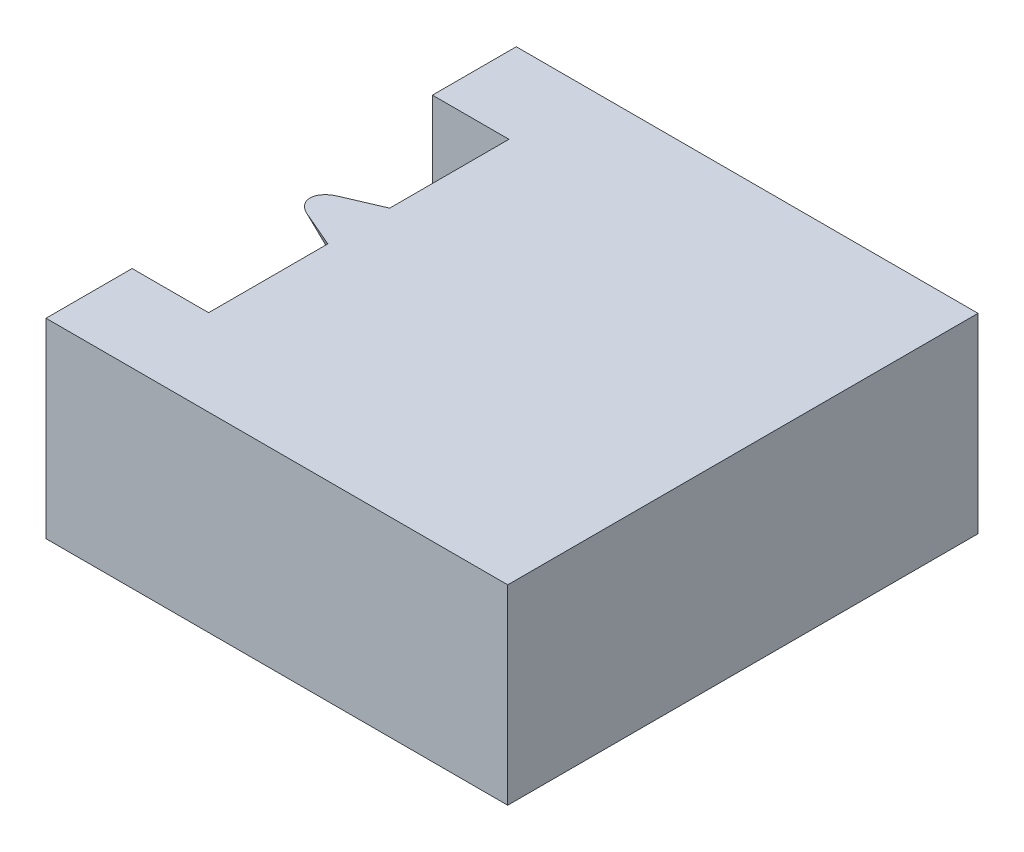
from build123d import *

# Parameters (mm, degrees)
SKIZZE1_W                       = 85.78807947
SKIZZE1_H                       = 57.19205298
LINEAR_AUSTRAGEN1_DEPTH         = 12.5
LINEAR_AUSTRAGEN2_DEPTH         = 12.5
VERRUNDUNG1_R                   = 2
LINEAR_AUSTRAGEN3_REACH         = 63.406
SKIZZE5_W                       = 85.78807947
SKIZZE5_H                       = 12.5
SCHNITT_LINEAR_AUSTRAGEN1_DEPTH = 57.19205298


with BuildPart() as part:
    # Skizze1 → Linear austragen1 (new body)
    with BuildSketch(Plane(origin=(0, 0, 0), x_dir=(1, 0, 0), z_dir=(0, 1, 0))):
        with Locations((-1.787251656, -4.766004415)):
            Rectangle(SKIZZE1_W, SKIZZE1_H)
    extrude(amount=LINEAR_AUSTRAGEN1_DEPTH)

    # Skizze2 → Linear austragen2 (add)
    with BuildSketch(Plane.XZ):
        Polygon((-17.700024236, 15.421191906), (-10.691056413, 15.421191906), (-10.691056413, -4.240857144), (-17.700024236, -4.240857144), (-17.700024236, -9.72954384), (12.52981167, -9.72954384), (12.52981167, 21.059107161), (-17.700024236, 21.059107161), align=None)
    extrude(amount=LINEAR_AUSTRAGEN2_DEPTH)

    # Verrundung1
    verrundung1_edges = [part.edges().sort_by_distance(p)[0] for p in [
        (-10.691056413, 0, 5.590167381),
    ]]
    fillet(verrundung1_edges, radius=VERRUNDUNG1_R)

    # Linear austragen3: up to this plane
    linear_austragen3_end = Plane(origin=(-44.681291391, 0, 33.362030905), z_dir=(0, 1, 0))
    # Skizze4 → Linear austragen3 (add, up to the surface)
    with BuildSketch(Plane(origin=(-9.497794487, -6.057276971, 5.590167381), x_dir=(0, 0, 1), z_dir=(-0.7251440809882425, 0.6885971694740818, 0)), mode=Mode.PRIVATE) as linear_austragen3_sk1:
        with BuildLine():
            Line((-1.005968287, 0.558415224), (-2.925192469, 3.638122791))
            Line((-2.925192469, 3.638122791), (2.925192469, 3.638122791))
            Line((2.925192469, 3.638122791), (1.005968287, 0.558415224))
            ThreePointArc((1.005968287, 0.558415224), (0, 0), (-1.005968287, 0.558415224))
        make_face()
    linear_austragen3_tool1 = split(extrude(linear_austragen3_sk1.sketch, amount=LINEAR_AUSTRAGEN3_REACH, mode=Mode.PRIVATE), bisect_by=linear_austragen3_end, keep=Keep.BOTH, mode=Mode.PRIVATE)
    add(linear_austragen3_tool1.solids().sort_by_distance((-7.965875, -4.444052, 5.590167))[0])

    # Skizze5 → Schnitt-Linear austragen1 (cut)
    with BuildSketch(Plane(origin=(0, 0, -23.830022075), x_dir=(-1, 0, 0), z_dir=(0, 0, -1))):
        with Locations((1.787251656, 6.25)):
            Rectangle(SKIZZE5_W, SKIZZE5_H)
    extrude(amount=-SCHNITT_LINEAR_AUSTRAGEN1_DEPTH, mode=Mode.SUBTRACT)


solid = part.part
